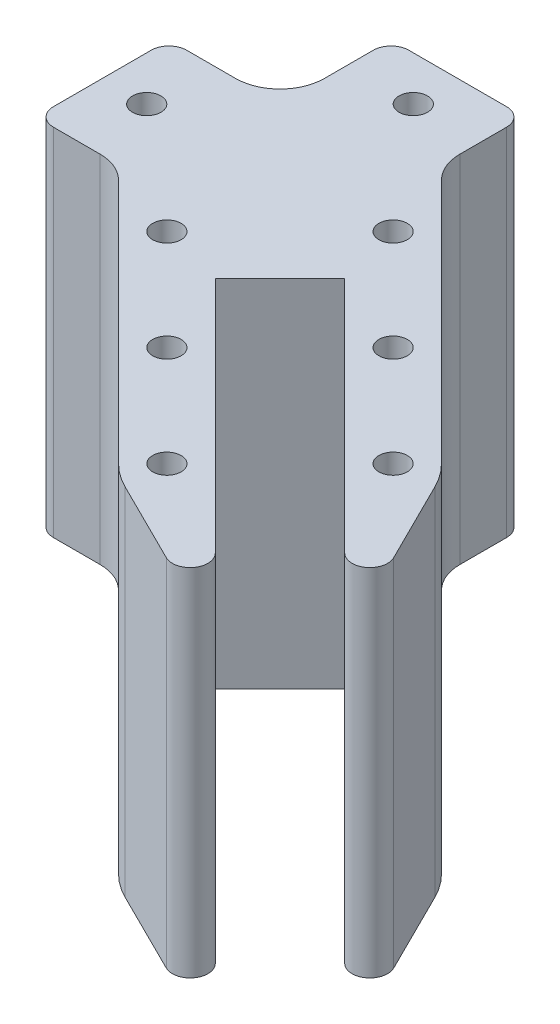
ISO-10303-21;
HEADER;
FILE_DESCRIPTION(('STEP AP214'),'2;1');
FILE_NAME('part.step','',(''),(''),'','','');
FILE_SCHEMA(('AUTOMOTIVE_DESIGN { 1 0 10303 214 1 1 1 1 }'));
ENDSEC;
DATA;
#1=APPLICATION_CONTEXT('core data for automotive mechanical design processes');
#2=APPLICATION_PROTOCOL_DEFINITION('international standard','automotive_design',2000,#1);
#3=PRODUCT_CONTEXT('',#1,'mechanical');
#4=PRODUCT('Part','Part','',(#3));
#5=PRODUCT_RELATED_PRODUCT_CATEGORY('part','',(#4));
#6=PRODUCT_DEFINITION_FORMATION('','',#4);
#7=PRODUCT_DEFINITION_CONTEXT('part definition',#1,'design');
#8=PRODUCT_DEFINITION('design','',#6,#7);
#9=PRODUCT_DEFINITION_SHAPE('','',#8);
#10=(LENGTH_UNIT() NAMED_UNIT(*) SI_UNIT(.MILLI.,.METRE.));
#11=(NAMED_UNIT(*) PLANE_ANGLE_UNIT() SI_UNIT($,.RADIAN.));
#12=(NAMED_UNIT(*) SI_UNIT($,.STERADIAN.) SOLID_ANGLE_UNIT());
#13=UNCERTAINTY_MEASURE_WITH_UNIT(LENGTH_MEASURE(1.E-05),#10,'distance_accuracy_value','');
#14=(GEOMETRIC_REPRESENTATION_CONTEXT(3) GLOBAL_UNCERTAINTY_ASSIGNED_CONTEXT((#13)) GLOBAL_UNIT_ASSIGNED_CONTEXT((#10,
#11,#12)) REPRESENTATION_CONTEXT('',''));
#15=CARTESIAN_POINT('',(0.,0.,0.));
#16=DIRECTION('',(0.,0.,1.));
#17=DIRECTION('',(1.,0.,0.));
#18=AXIS2_PLACEMENT_3D('',#15,#16,#17);
#19=CARTESIAN_POINT('',(69.3138164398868,40.,59.2021894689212));
#20=DIRECTION('',(0.,1.,0.));
#21=DIRECTION('',(0.,0.,1.));
#22=AXIS2_PLACEMENT_3D('',#19,#20,#21);
#23=PLANE('',#22);
#24=CARTESIAN_POINT('',(39.2821792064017,40.,26.5542571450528));
#25=DIRECTION('',(0.,1.,0.));
#26=DIRECTION('',(0.,0.,1.));
#27=AXIS2_PLACEMENT_3D('',#24,#25,#26);
#28=CIRCLE('',#27,1.60000000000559);
#29=CARTESIAN_POINT('',(39.2821792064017,40.,28.1542571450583));
#30=VERTEX_POINT('',#29);
#31=EDGE_CURVE('E770',#30,#30,#28,.T.);
#32=ORIENTED_EDGE('',*,*,#31,.F.);
#33=EDGE_LOOP('',(#32));
#34=FACE_BOUND('',#33,.T.);
#35=CARTESIAN_POINT('',(26.5542571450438,40.,39.2821792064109));
#36=DIRECTION('',(0.,1.,0.));
#37=DIRECTION('',(0.,0.,1.));
#38=AXIS2_PLACEMENT_3D('',#35,#36,#37);
#39=CIRCLE('',#38,1.6000000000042);
#40=CARTESIAN_POINT('',(26.5542571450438,40.,40.8821792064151));
#41=VERTEX_POINT('',#40);
#42=EDGE_CURVE('E790',#41,#41,#39,.T.);
#43=ORIENTED_EDGE('',*,*,#42,.F.);
#44=EDGE_LOOP('',(#43));
#45=FACE_BOUND('',#44,.T.);
#46=CARTESIAN_POINT('',(49.1816741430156,40.,61.9095962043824));
#47=DIRECTION('',(0.,1.,0.));
#48=DIRECTION('',(0.,0.,1.));
#49=AXIS2_PLACEMENT_3D('',#46,#47,#48);
#50=CIRCLE('',#49,1.60000000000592);
#51=CARTESIAN_POINT('',(49.1816741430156,40.,63.5095962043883));
#52=VERTEX_POINT('',#51);
#53=EDGE_CURVE('E802',#52,#52,#50,.T.);
#54=ORIENTED_EDGE('',*,*,#53,.F.);
#55=EDGE_LOOP('',(#54));
#56=FACE_BOUND('',#55,.T.);
#57=CARTESIAN_POINT('',(28.,40.,13.));
#58=DIRECTION('',(0.,1.,0.));
#59=DIRECTION('',(0.,0.,1.));
#60=AXIS2_PLACEMENT_3D('',#57,#58,#59);
#61=CIRCLE('',#60,1.6);
#62=CARTESIAN_POINT('',(28.,40.,14.6));
#63=VERTEX_POINT('',#62);
#64=EDGE_CURVE('E410',#63,#63,#61,.T.);
#65=ORIENTED_EDGE('',*,*,#64,.F.);
#66=EDGE_LOOP('',(#65));
#67=FACE_BOUND('',#66,.T.);
#68=DIRECTION('',(0.,0.,-1.));
#69=VECTOR('',#68,1.);
#70=CARTESIAN_POINT('',(35.5,40.,17.3273557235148));
#71=LINE('',#70,#69);
#72=CARTESIAN_POINT('',(35.5,40.,15.2562879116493));
#73=VERTEX_POINT('',#72);
#74=CARTESIAN_POINT('',(35.5,40.,10.));
#75=VERTEX_POINT('',#74);
#76=EDGE_CURVE('E413',#73,#75,#71,.T.);
#77=ORIENTED_EDGE('',*,*,#76,.T.);
#78=CARTESIAN_POINT('',(33.5,40.,10.));
#79=DIRECTION('',(0.,1.,0.));
#80=DIRECTION('',(0.,0.,1.));
#81=AXIS2_PLACEMENT_3D('',#78,#79,#80);
#82=CIRCLE('',#81,2.);
#83=CARTESIAN_POINT('',(33.5,40.,8.));
#84=VERTEX_POINT('',#83);
#85=EDGE_CURVE('E283',#75,#84,#82,.T.);
#86=ORIENTED_EDGE('',*,*,#85,.T.);
#87=DIRECTION('',(-1.,0.,0.));
#88=VECTOR('',#87,1.);
#89=CARTESIAN_POINT('',(35.5,40.,8.));
#90=LINE('',#89,#88);
#91=CARTESIAN_POINT('',(22.5,40.,8.));
#92=VERTEX_POINT('',#91);
#93=EDGE_CURVE('E392',#84,#92,#90,.T.);
#94=ORIENTED_EDGE('',*,*,#93,.T.);
#95=CARTESIAN_POINT('',(22.5,40.,10.));
#96=DIRECTION('',(0.,1.,0.));
#97=DIRECTION('',(0.,0.,1.));
#98=AXIS2_PLACEMENT_3D('',#95,#96,#97);
#99=CIRCLE('',#98,2.);
#100=CARTESIAN_POINT('',(20.5,40.,10.));
#101=VERTEX_POINT('',#100);
#102=EDGE_CURVE('E281',#92,#101,#99,.T.);
#103=ORIENTED_EDGE('',*,*,#102,.T.);
#104=DIRECTION('',(0.,0.,1.));
#105=VECTOR('',#104,1.);
#106=CARTESIAN_POINT('',(20.5,40.,8.));
#107=LINE('',#106,#105);
#108=CARTESIAN_POINT('',(20.5,40.,15.5));
#109=VERTEX_POINT('',#108);
#110=EDGE_CURVE('E385',#101,#109,#107,.T.);
#111=ORIENTED_EDGE('',*,*,#110,.T.);
#112=CARTESIAN_POINT('',(15.5,40.,15.5));
#113=DIRECTION('',(0.,1.,0.));
#114=DIRECTION('',(0.,0.,1.));
#115=AXIS2_PLACEMENT_3D('',#112,#113,#114);
#116=CIRCLE('',#115,5.);
#117=CARTESIAN_POINT('',(15.5,40.,20.5));
#118=VERTEX_POINT('',#117);
#119=EDGE_CURVE('E256',#109,#118,#116,.F.);
#120=ORIENTED_EDGE('',*,*,#119,.T.);
#121=DIRECTION('',(-1.,0.,0.));
#122=VECTOR('',#121,1.);
#123=CARTESIAN_POINT('',(20.5,40.,20.5));
#124=LINE('',#123,#122);
#125=CARTESIAN_POINT('',(10.,40.,20.5));
#126=VERTEX_POINT('',#125);
#127=EDGE_CURVE('E384',#118,#126,#124,.T.);
#128=ORIENTED_EDGE('',*,*,#127,.T.);
#129=CARTESIAN_POINT('',(10.,40.,22.5));
#130=DIRECTION('',(0.,1.,0.));
#131=DIRECTION('',(0.,0.,1.));
#132=AXIS2_PLACEMENT_3D('',#129,#130,#131);
#133=CIRCLE('',#132,2.);
#134=CARTESIAN_POINT('',(8.,40.,22.5));
#135=VERTEX_POINT('',#134);
#136=EDGE_CURVE('E278',#126,#135,#133,.T.);
#137=ORIENTED_EDGE('',*,*,#136,.T.);
#138=DIRECTION('',(0.,0.,1.));
#139=VECTOR('',#138,1.);
#140=CARTESIAN_POINT('',(8.,40.,20.5));
#141=LINE('',#140,#139);
#142=CARTESIAN_POINT('',(8.,40.,33.5));
#143=VERTEX_POINT('',#142);
#144=EDGE_CURVE('E297',#135,#143,#141,.T.);
#145=ORIENTED_EDGE('',*,*,#144,.T.);
#146=CARTESIAN_POINT('',(10.,40.,33.5));
#147=DIRECTION('',(0.,1.,0.));
#148=DIRECTION('',(0.,0.,1.));
#149=AXIS2_PLACEMENT_3D('',#146,#147,#148);
#150=CIRCLE('',#149,2.);
#151=CARTESIAN_POINT('',(10.,40.,35.5));
#152=VERTEX_POINT('',#151);
#153=EDGE_CURVE('E56',#143,#152,#150,.T.);
#154=ORIENTED_EDGE('',*,*,#153,.T.);
#155=DIRECTION('',(1.,0.,0.));
#156=VECTOR('',#155,1.);
#157=CARTESIAN_POINT('',(8.,40.,35.5));
#158=LINE('',#157,#156);
#159=CARTESIAN_POINT('',(15.256287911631,40.,35.5));
#160=VERTEX_POINT('',#159);
#161=EDGE_CURVE('E390',#152,#160,#158,.T.);
#162=ORIENTED_EDGE('',*,*,#161,.T.);
#163=CARTESIAN_POINT('',(15.256287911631,40.,40.5));
#164=DIRECTION('',(0.,1.,0.));
#165=DIRECTION('',(0.,0.,1.));
#166=AXIS2_PLACEMENT_3D('',#163,#164,#165);
#167=CIRCLE('',#166,5.);
#168=CARTESIAN_POINT('',(18.7918218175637,40.,36.9644660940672));
#169=VERTEX_POINT('',#168);
#170=EDGE_CURVE('E261',#160,#169,#167,.F.);
#171=ORIENTED_EDGE('',*,*,#170,.T.);
#172=DIRECTION('',(0.707106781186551,0.,0.707106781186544));
#173=VECTOR('',#172,1.);
#174=CARTESIAN_POINT('',(17.3273557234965,40.,35.5));
#175=LINE('',#174,#173);
#176=CARTESIAN_POINT('',(46.4593130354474,40.,64.6319573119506));
#177=VERTEX_POINT('',#176);
#178=EDGE_CURVE('E397',#169,#177,#175,.T.);
#179=ORIENTED_EDGE('',*,*,#178,.T.);
#180=CARTESIAN_POINT('',(53.5332062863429,40.,57.5580640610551));
#181=DIRECTION('',(0.,1.,0.));
#182=DIRECTION('',(0.,0.,1.));
#183=AXIS2_PLACEMENT_3D('',#180,#181,#182);
#184=CIRCLE('',#183,10.0039957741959);
#185=CARTESIAN_POINT('',(49.080609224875,40.,66.5165411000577));
#186=VERTEX_POINT('',#185);
#187=EDGE_CURVE('E399',#177,#186,#184,.T.);
#188=ORIENTED_EDGE('',*,*,#187,.T.);
#189=DIRECTION('',(0.895489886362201,0.,0.445081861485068));
#190=VECTOR('',#189,1.);
#191=CARTESIAN_POINT('',(49.080609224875,40.,66.5165411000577));
#192=LINE('',#191,#190);
#193=CARTESIAN_POINT('',(58.3120257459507,40.,71.1047962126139));
#194=VERTEX_POINT('',#193);
#195=EDGE_CURVE('E401',#186,#194,#192,.T.);
#196=ORIENTED_EDGE('',*,*,#195,.T.);
#197=CARTESIAN_POINT('',(59.2021894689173,40.,69.313816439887));
#198=DIRECTION('',(0.,1.,0.));
#199=DIRECTION('',(0.,0.,-1.));
#200=AXIS2_PLACEMENT_3D('',#197,#198,#199);
#201=CIRCLE('',#200,2.00000000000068);
#202=CARTESIAN_POINT('',(60.6164030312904,40.,67.8996028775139));
#203=VERTEX_POINT('',#202);
#204=EDGE_CURVE('E403',#194,#203,#201,.T.);
#205=ORIENTED_EDGE('',*,*,#204,.T.);
#206=DIRECTION('',(-0.70710678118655,0.,-0.707106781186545));
#207=VECTOR('',#206,1.);
#208=CARTESIAN_POINT('',(60.6164030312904,40.,67.8996028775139));
#209=LINE('',#208,#207);
#210=CARTESIAN_POINT('',(33.8728123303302,40.,41.1560121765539));
#211=VERTEX_POINT('',#210);
#212=EDGE_CURVE('E405',#203,#211,#209,.T.);
#213=ORIENTED_EDGE('',*,*,#212,.T.);
#214=DIRECTION('',(0.707106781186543,0.,-0.707106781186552));
#215=VECTOR('',#214,1.);
#216=CARTESIAN_POINT('',(33.8728123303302,40.,41.1560121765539));
#217=LINE('',#216,#215);
#218=CARTESIAN_POINT('',(41.1560121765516,40.,33.8728123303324));
#219=VERTEX_POINT('',#218);
#220=EDGE_CURVE('E407',#211,#219,#217,.T.);
#221=ORIENTED_EDGE('',*,*,#220,.T.);
#222=DIRECTION('',(0.707106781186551,0.,0.707106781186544));
#223=VECTOR('',#222,1.);
#224=CARTESIAN_POINT('',(41.1560121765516,40.,33.8728123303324));
#225=LINE('',#224,#223);
#226=CARTESIAN_POINT('',(67.8996028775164,40.,60.6164030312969));
#227=VERTEX_POINT('',#226);
#228=EDGE_CURVE('E218',#219,#227,#225,.T.);
#229=ORIENTED_EDGE('',*,*,#228,.T.);
#230=CARTESIAN_POINT('',(69.3138164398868,40.,59.2021894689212));
#231=DIRECTION('',(0.,1.,0.));
#232=DIRECTION('',(0.,0.,1.));
#233=AXIS2_PLACEMENT_3D('',#230,#231,#232);
#234=CIRCLE('',#233,2.00000000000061);
#235=CARTESIAN_POINT('',(71.1047962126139,40.,58.3120257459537));
#236=VERTEX_POINT('',#235);
#237=EDGE_CURVE('E212',#227,#236,#234,.T.);
#238=ORIENTED_EDGE('',*,*,#237,.T.);
#239=DIRECTION('',(-0.445081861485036,0.,-0.895489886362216));
#240=VECTOR('',#239,1.);
#241=CARTESIAN_POINT('',(71.1047962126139,40.,58.3120257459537));
#242=LINE('',#241,#240);
#243=CARTESIAN_POINT('',(66.516541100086,40.,49.0806092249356));
#244=VERTEX_POINT('',#243);
#245=EDGE_CURVE('E202',#236,#244,#242,.T.);
#246=ORIENTED_EDGE('',*,*,#245,.T.);
#247=CARTESIAN_POINT('',(57.558064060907,40.,53.5332062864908));
#248=DIRECTION('',(0.,1.,0.));
#249=DIRECTION('',(0.,0.,-1.));
#250=AXIS2_PLACEMENT_3D('',#247,#248,#249);
#251=CIRCLE('',#250,10.0039957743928);
#252=CARTESIAN_POINT('',(64.6319573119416,40.,46.459313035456));
#253=VERTEX_POINT('',#252);
#254=EDGE_CURVE('E211',#244,#253,#251,.T.);
#255=ORIENTED_EDGE('',*,*,#254,.T.);
#256=DIRECTION('',(-0.707106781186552,0.,-0.707106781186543));
#257=VECTOR('',#256,1.);
#258=CARTESIAN_POINT('',(64.6319573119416,40.,46.459313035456));
#259=LINE('',#258,#257);
#260=CARTESIAN_POINT('',(36.9644660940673,40.,18.791821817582));
#261=VERTEX_POINT('',#260);
#262=EDGE_CURVE('E357',#253,#261,#259,.T.);
#263=ORIENTED_EDGE('',*,*,#262,.T.);
#264=CARTESIAN_POINT('',(40.5,40.,15.2562879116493));
#265=DIRECTION('',(0.,1.,0.));
#266=DIRECTION('',(0.,0.,1.));
#267=AXIS2_PLACEMENT_3D('',#264,#265,#266);
#268=CIRCLE('',#267,5.);
#269=EDGE_CURVE('E251',#261,#73,#268,.F.);
#270=ORIENTED_EDGE('',*,*,#269,.T.);
#271=EDGE_LOOP('',(#77,#86,#94,#103,#111,#120,#128,#137,#145,#154,#162,#171,#179,#188,#196,#205,
#213,#221,#229,#238,#246,#255,#263,#270));
#272=FACE_BOUND('',#271,.T.);
#273=CARTESIAN_POINT('',(13.,40.,28.));
#274=DIRECTION('',(0.,1.,0.));
#275=DIRECTION('',(0.,0.,1.));
#276=AXIS2_PLACEMENT_3D('',#273,#274,#275);
#277=CIRCLE('',#276,1.6);
#278=CARTESIAN_POINT('',(13.,40.,29.6));
#279=VERTEX_POINT('',#278);
#280=EDGE_CURVE('E808',#279,#279,#277,.T.);
#281=ORIENTED_EDGE('',*,*,#280,.F.);
#282=EDGE_LOOP('',(#281));
#283=FACE_BOUND('',#282,.T.);
#284=CARTESIAN_POINT('',(37.8679656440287,40.,50.5958877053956));
#285=DIRECTION('',(0.,1.,0.));
#286=DIRECTION('',(0.,0.,1.));
#287=AXIS2_PLACEMENT_3D('',#284,#285,#286);
#288=CIRCLE('',#287,1.6000000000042);
#289=CARTESIAN_POINT('',(37.8679656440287,40.,52.1958877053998));
#290=VERTEX_POINT('',#289);
#291=EDGE_CURVE('E796',#290,#290,#288,.T.);
#292=ORIENTED_EDGE('',*,*,#291,.F.);
#293=EDGE_LOOP('',(#292));
#294=FACE_BOUND('',#293,.T.);
#295=CARTESIAN_POINT('',(50.5958877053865,40.,37.8679656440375));
#296=DIRECTION('',(0.,1.,0.));
#297=DIRECTION('',(0.,0.,1.));
#298=AXIS2_PLACEMENT_3D('',#295,#296,#297);
#299=CIRCLE('',#298,1.60000000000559);
#300=CARTESIAN_POINT('',(50.5958877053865,40.,39.4679656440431));
#301=VERTEX_POINT('',#300);
#302=EDGE_CURVE('E784',#301,#301,#299,.T.);
#303=ORIENTED_EDGE('',*,*,#302,.F.);
#304=EDGE_LOOP('',(#303));
#305=FACE_BOUND('',#304,.T.);
#306=CARTESIAN_POINT('',(61.9095962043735,40.,49.1816741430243));
#307=DIRECTION('',(0.,1.,0.));
#308=DIRECTION('',(0.,0.,1.));
#309=AXIS2_PLACEMENT_3D('',#306,#307,#308);
#310=CIRCLE('',#309,1.60000000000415);
#311=CARTESIAN_POINT('',(61.9095962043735,40.,50.7816741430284));
#312=VERTEX_POINT('',#311);
#313=EDGE_CURVE('E775',#312,#312,#310,.T.);
#314=ORIENTED_EDGE('',*,*,#313,.F.);
#315=EDGE_LOOP('',(#314));
#316=FACE_BOUND('',#315,.T.);
#317=ADVANCED_FACE('F41',(#34,#45,#56,#67,#272,#283,#294,#305,#316),#23,.T.);
#318=CARTESIAN_POINT('',(69.3138164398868,0.,59.2021894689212));
#319=DIRECTION('',(0.,1.,0.));
#320=DIRECTION('',(0.,0.,1.));
#321=AXIS2_PLACEMENT_3D('',#318,#319,#320);
#322=PLANE('',#321);
#323=DIRECTION('',(-1.,0.,0.));
#324=VECTOR('',#323,1.);
#325=CARTESIAN_POINT('',(35.5,0.,8.));
#326=LINE('',#325,#324);
#327=CARTESIAN_POINT('',(33.5,0.,8.));
#328=VERTEX_POINT('',#327);
#329=CARTESIAN_POINT('',(22.5,0.,8.));
#330=VERTEX_POINT('',#329);
#331=EDGE_CURVE('E365',#328,#330,#326,.T.);
#332=ORIENTED_EDGE('',*,*,#331,.F.);
#333=CARTESIAN_POINT('',(33.5,0.,10.));
#334=DIRECTION('',(0.,1.,0.));
#335=DIRECTION('',(0.,0.,1.));
#336=AXIS2_PLACEMENT_3D('',#333,#334,#335);
#337=CIRCLE('',#336,2.);
#338=CARTESIAN_POINT('',(35.5,0.,10.));
#339=VERTEX_POINT('',#338);
#340=EDGE_CURVE('E274',#328,#339,#337,.F.);
#341=ORIENTED_EDGE('',*,*,#340,.T.);
#342=DIRECTION('',(0.,0.,-1.));
#343=VECTOR('',#342,1.);
#344=CARTESIAN_POINT('',(35.5,0.,17.3273557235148));
#345=LINE('',#344,#343);
#346=CARTESIAN_POINT('',(35.5,0.,15.2562879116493));
#347=VERTEX_POINT('',#346);
#348=EDGE_CURVE('E362',#347,#339,#345,.T.);
#349=ORIENTED_EDGE('',*,*,#348,.F.);
#350=CARTESIAN_POINT('',(40.5,0.,15.2562879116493));
#351=DIRECTION('',(0.,1.,0.));
#352=DIRECTION('',(0.,0.,1.));
#353=AXIS2_PLACEMENT_3D('',#350,#351,#352);
#354=CIRCLE('',#353,5.);
#355=CARTESIAN_POINT('',(36.9644660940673,0.,18.791821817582));
#356=VERTEX_POINT('',#355);
#357=EDGE_CURVE('E249',#347,#356,#354,.T.);
#358=ORIENTED_EDGE('',*,*,#357,.T.);
#359=DIRECTION('',(-0.707106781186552,0.,-0.707106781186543));
#360=VECTOR('',#359,1.);
#361=CARTESIAN_POINT('',(64.6319573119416,0.,46.459313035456));
#362=LINE('',#361,#360);
#363=CARTESIAN_POINT('',(64.6319573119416,0.,46.459313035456));
#364=VERTEX_POINT('',#363);
#365=EDGE_CURVE('E354',#364,#356,#362,.T.);
#366=ORIENTED_EDGE('',*,*,#365,.F.);
#367=CARTESIAN_POINT('',(57.558064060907,0.,53.5332062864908));
#368=DIRECTION('',(0.,1.,0.));
#369=DIRECTION('',(0.,0.,-1.));
#370=AXIS2_PLACEMENT_3D('',#367,#368,#369);
#371=CIRCLE('',#370,10.0039957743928);
#372=CARTESIAN_POINT('',(66.516541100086,0.,49.0806092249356));
#373=VERTEX_POINT('',#372);
#374=EDGE_CURVE('E360',#373,#364,#371,.T.);
#375=ORIENTED_EDGE('',*,*,#374,.F.);
#376=DIRECTION('',(-0.445081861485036,0.,-0.895489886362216));
#377=VECTOR('',#376,1.);
#378=CARTESIAN_POINT('',(71.1047962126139,0.,58.3120257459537));
#379=LINE('',#378,#377);
#380=CARTESIAN_POINT('',(71.1047962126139,0.,58.3120257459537));
#381=VERTEX_POINT('',#380);
#382=EDGE_CURVE('E367',#381,#373,#379,.T.);
#383=ORIENTED_EDGE('',*,*,#382,.F.);
#384=CARTESIAN_POINT('',(69.3138164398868,0.,59.2021894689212));
#385=DIRECTION('',(0.,1.,0.));
#386=DIRECTION('',(0.,0.,1.));
#387=AXIS2_PLACEMENT_3D('',#384,#385,#386);
#388=CIRCLE('',#387,2.00000000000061);
#389=CARTESIAN_POINT('',(67.8996028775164,0.,60.6164030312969));
#390=VERTEX_POINT('',#389);
#391=EDGE_CURVE('E226',#390,#381,#388,.T.);
#392=ORIENTED_EDGE('',*,*,#391,.F.);
#393=DIRECTION('',(0.707106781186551,0.,0.707106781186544));
#394=VECTOR('',#393,1.);
#395=CARTESIAN_POINT('',(41.1560121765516,0.,33.8728123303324));
#396=LINE('',#395,#394);
#397=CARTESIAN_POINT('',(41.1560121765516,0.,33.8728123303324));
#398=VERTEX_POINT('',#397);
#399=EDGE_CURVE('E222',#398,#390,#396,.T.);
#400=ORIENTED_EDGE('',*,*,#399,.F.);
#401=DIRECTION('',(0.707106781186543,0.,-0.707106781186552));
#402=VECTOR('',#401,1.);
#403=CARTESIAN_POINT('',(33.8728123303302,0.,41.1560121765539));
#404=LINE('',#403,#402);
#405=CARTESIAN_POINT('',(33.8728123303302,0.,41.1560121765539));
#406=VERTEX_POINT('',#405);
#407=EDGE_CURVE('E325',#406,#398,#404,.T.);
#408=ORIENTED_EDGE('',*,*,#407,.F.);
#409=DIRECTION('',(-0.70710678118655,0.,-0.707106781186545));
#410=VECTOR('',#409,1.);
#411=CARTESIAN_POINT('',(60.6164030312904,0.,67.8996028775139));
#412=LINE('',#411,#410);
#413=CARTESIAN_POINT('',(60.6164030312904,0.,67.8996028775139));
#414=VERTEX_POINT('',#413);
#415=EDGE_CURVE('E323',#414,#406,#412,.T.);
#416=ORIENTED_EDGE('',*,*,#415,.F.);
#417=CARTESIAN_POINT('',(59.2021894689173,0.,69.313816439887));
#418=DIRECTION('',(0.,1.,0.));
#419=DIRECTION('',(0.,0.,-1.));
#420=AXIS2_PLACEMENT_3D('',#417,#418,#419);
#421=CIRCLE('',#420,2.00000000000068);
#422=CARTESIAN_POINT('',(58.3120257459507,0.,71.1047962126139));
#423=VERTEX_POINT('',#422);
#424=EDGE_CURVE('E321',#423,#414,#421,.T.);
#425=ORIENTED_EDGE('',*,*,#424,.F.);
#426=DIRECTION('',(0.895489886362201,0.,0.445081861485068));
#427=VECTOR('',#426,1.);
#428=CARTESIAN_POINT('',(49.080609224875,0.,66.5165411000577));
#429=LINE('',#428,#427);
#430=CARTESIAN_POINT('',(49.080609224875,0.,66.5165411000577));
#431=VERTEX_POINT('',#430);
#432=EDGE_CURVE('E319',#431,#423,#429,.T.);
#433=ORIENTED_EDGE('',*,*,#432,.F.);
#434=CARTESIAN_POINT('',(53.5332062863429,0.,57.5580640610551));
#435=DIRECTION('',(0.,1.,0.));
#436=DIRECTION('',(0.,0.,1.));
#437=AXIS2_PLACEMENT_3D('',#434,#435,#436);
#438=CIRCLE('',#437,10.0039957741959);
#439=CARTESIAN_POINT('',(46.4593130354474,0.,64.6319573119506));
#440=VERTEX_POINT('',#439);
#441=EDGE_CURVE('E317',#440,#431,#438,.T.);
#442=ORIENTED_EDGE('',*,*,#441,.F.);
#443=DIRECTION('',(0.707106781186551,0.,0.707106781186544));
#444=VECTOR('',#443,1.);
#445=CARTESIAN_POINT('',(17.3273557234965,0.,35.5));
#446=LINE('',#445,#444);
#447=CARTESIAN_POINT('',(18.7918218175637,0.,36.9644660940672));
#448=VERTEX_POINT('',#447);
#449=EDGE_CURVE('E310',#448,#440,#446,.T.);
#450=ORIENTED_EDGE('',*,*,#449,.F.);
#451=CARTESIAN_POINT('',(15.256287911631,0.,40.5));
#452=DIRECTION('',(0.,1.,0.));
#453=DIRECTION('',(0.,0.,1.));
#454=AXIS2_PLACEMENT_3D('',#451,#452,#453);
#455=CIRCLE('',#454,5.);
#456=CARTESIAN_POINT('',(15.256287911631,0.,35.5));
#457=VERTEX_POINT('',#456);
#458=EDGE_CURVE('E258',#448,#457,#455,.T.);
#459=ORIENTED_EDGE('',*,*,#458,.T.);
#460=DIRECTION('',(1.,0.,0.));
#461=VECTOR('',#460,1.);
#462=CARTESIAN_POINT('',(8.,0.,35.5));
#463=LINE('',#462,#461);
#464=CARTESIAN_POINT('',(10.,0.,35.5));
#465=VERTEX_POINT('',#464);
#466=EDGE_CURVE('E307',#465,#457,#463,.T.);
#467=ORIENTED_EDGE('',*,*,#466,.F.);
#468=CARTESIAN_POINT('',(10.,0.,33.5));
#469=DIRECTION('',(0.,1.,0.));
#470=DIRECTION('',(0.,0.,1.));
#471=AXIS2_PLACEMENT_3D('',#468,#469,#470);
#472=CIRCLE('',#471,2.);
#473=CARTESIAN_POINT('',(8.,0.,33.5));
#474=VERTEX_POINT('',#473);
#475=EDGE_CURVE('E270',#465,#474,#472,.F.);
#476=ORIENTED_EDGE('',*,*,#475,.T.);
#477=DIRECTION('',(0.,0.,1.));
#478=VECTOR('',#477,1.);
#479=CARTESIAN_POINT('',(8.,0.,20.5));
#480=LINE('',#479,#478);
#481=CARTESIAN_POINT('',(8.,0.,22.5));
#482=VERTEX_POINT('',#481);
#483=EDGE_CURVE('E296',#482,#474,#480,.T.);
#484=ORIENTED_EDGE('',*,*,#483,.F.);
#485=CARTESIAN_POINT('',(10.,0.,22.5));
#486=DIRECTION('',(0.,1.,0.));
#487=DIRECTION('',(0.,0.,1.));
#488=AXIS2_PLACEMENT_3D('',#485,#486,#487);
#489=CIRCLE('',#488,2.);
#490=CARTESIAN_POINT('',(10.,0.,20.5));
#491=VERTEX_POINT('',#490);
#492=EDGE_CURVE('E268',#482,#491,#489,.F.);
#493=ORIENTED_EDGE('',*,*,#492,.T.);
#494=DIRECTION('',(-1.,0.,0.));
#495=VECTOR('',#494,1.);
#496=CARTESIAN_POINT('',(20.5,0.,20.5));
#497=LINE('',#496,#495);
#498=CARTESIAN_POINT('',(15.5,0.,20.5));
#499=VERTEX_POINT('',#498);
#500=EDGE_CURVE('E308',#499,#491,#497,.T.);
#501=ORIENTED_EDGE('',*,*,#500,.F.);
#502=CARTESIAN_POINT('',(15.5,0.,15.5));
#503=DIRECTION('',(0.,1.,0.));
#504=DIRECTION('',(0.,0.,1.));
#505=AXIS2_PLACEMENT_3D('',#502,#503,#504);
#506=CIRCLE('',#505,5.);
#507=CARTESIAN_POINT('',(20.5,0.,15.5));
#508=VERTEX_POINT('',#507);
#509=EDGE_CURVE('E253',#499,#508,#506,.T.);
#510=ORIENTED_EDGE('',*,*,#509,.T.);
#511=DIRECTION('',(0.,0.,1.));
#512=VECTOR('',#511,1.);
#513=CARTESIAN_POINT('',(20.5,0.,8.));
#514=LINE('',#513,#512);
#515=CARTESIAN_POINT('',(20.5,0.,10.));
#516=VERTEX_POINT('',#515);
#517=EDGE_CURVE('E312',#516,#508,#514,.T.);
#518=ORIENTED_EDGE('',*,*,#517,.F.);
#519=CARTESIAN_POINT('',(22.5,0.,10.));
#520=DIRECTION('',(0.,1.,0.));
#521=DIRECTION('',(0.,0.,1.));
#522=AXIS2_PLACEMENT_3D('',#519,#520,#521);
#523=CIRCLE('',#522,2.);
#524=EDGE_CURVE('E272',#516,#330,#523,.F.);
#525=ORIENTED_EDGE('',*,*,#524,.T.);
#526=EDGE_LOOP('',(#332,#341,#349,#358,#366,#375,#383,#392,#400,#408,#416,#425,#433,#442,#450,
#459,#467,#476,#484,#493,#501,#510,#518,#525));
#527=FACE_BOUND('',#526,.T.);
#528=CARTESIAN_POINT('',(28.,0.,13.));
#529=DIRECTION('',(0.,1.,0.));
#530=DIRECTION('',(0.,0.,1.));
#531=AXIS2_PLACEMENT_3D('',#528,#529,#530);
#532=CIRCLE('',#531,1.6);
#533=CARTESIAN_POINT('',(28.,0.,14.6));
#534=VERTEX_POINT('',#533);
#535=EDGE_CURVE('E811',#534,#534,#532,.T.);
#536=ORIENTED_EDGE('',*,*,#535,.T.);
#537=EDGE_LOOP('',(#536));
#538=FACE_BOUND('',#537,.T.);
#539=CARTESIAN_POINT('',(13.,0.,28.));
#540=DIRECTION('',(0.,1.,0.));
#541=DIRECTION('',(0.,0.,1.));
#542=AXIS2_PLACEMENT_3D('',#539,#540,#541);
#543=CIRCLE('',#542,1.6);
#544=CARTESIAN_POINT('',(13.,0.,29.6));
#545=VERTEX_POINT('',#544);
#546=EDGE_CURVE('E805',#545,#545,#543,.T.);
#547=ORIENTED_EDGE('',*,*,#546,.T.);
#548=EDGE_LOOP('',(#547));
#549=FACE_BOUND('',#548,.T.);
#550=CARTESIAN_POINT('',(49.1816741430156,0.,61.9095962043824));
#551=DIRECTION('',(0.,1.,0.));
#552=DIRECTION('',(0.,0.,1.));
#553=AXIS2_PLACEMENT_3D('',#550,#551,#552);
#554=CIRCLE('',#553,1.60000000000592);
#555=CARTESIAN_POINT('',(49.1816741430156,0.,63.5095962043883));
#556=VERTEX_POINT('',#555);
#557=EDGE_CURVE('E799',#556,#556,#554,.T.);
#558=ORIENTED_EDGE('',*,*,#557,.T.);
#559=EDGE_LOOP('',(#558));
#560=FACE_BOUND('',#559,.T.);
#561=CARTESIAN_POINT('',(37.8679656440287,0.,50.5958877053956));
#562=DIRECTION('',(0.,1.,0.));
#563=DIRECTION('',(0.,0.,1.));
#564=AXIS2_PLACEMENT_3D('',#561,#562,#563);
#565=CIRCLE('',#564,1.6000000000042);
#566=CARTESIAN_POINT('',(37.8679656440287,0.,52.1958877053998));
#567=VERTEX_POINT('',#566);
#568=EDGE_CURVE('E793',#567,#567,#565,.T.);
#569=ORIENTED_EDGE('',*,*,#568,.T.);
#570=EDGE_LOOP('',(#569));
#571=FACE_BOUND('',#570,.T.);
#572=CARTESIAN_POINT('',(26.5542571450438,0.,39.2821792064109));
#573=DIRECTION('',(0.,1.,0.));
#574=DIRECTION('',(0.,0.,1.));
#575=AXIS2_PLACEMENT_3D('',#572,#573,#574);
#576=CIRCLE('',#575,1.6000000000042);
#577=CARTESIAN_POINT('',(26.5542571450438,0.,40.8821792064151));
#578=VERTEX_POINT('',#577);
#579=EDGE_CURVE('E787',#578,#578,#576,.T.);
#580=ORIENTED_EDGE('',*,*,#579,.T.);
#581=EDGE_LOOP('',(#580));
#582=FACE_BOUND('',#581,.T.);
#583=CARTESIAN_POINT('',(50.5958877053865,0.,37.8679656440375));
#584=DIRECTION('',(0.,1.,0.));
#585=DIRECTION('',(0.,0.,1.));
#586=AXIS2_PLACEMENT_3D('',#583,#584,#585);
#587=CIRCLE('',#586,1.60000000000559);
#588=CARTESIAN_POINT('',(50.5958877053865,0.,39.4679656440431));
#589=VERTEX_POINT('',#588);
#590=EDGE_CURVE('E777',#589,#589,#587,.T.);
#591=ORIENTED_EDGE('',*,*,#590,.T.);
#592=EDGE_LOOP('',(#591));
#593=FACE_BOUND('',#592,.T.);
#594=CARTESIAN_POINT('',(39.2821792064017,0.,26.5542571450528));
#595=DIRECTION('',(0.,1.,0.));
#596=DIRECTION('',(0.,0.,1.));
#597=AXIS2_PLACEMENT_3D('',#594,#595,#596);
#598=CIRCLE('',#597,1.60000000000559);
#599=CARTESIAN_POINT('',(39.2821792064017,0.,28.1542571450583));
#600=VERTEX_POINT('',#599);
#601=EDGE_CURVE('E773',#600,#600,#598,.T.);
#602=ORIENTED_EDGE('',*,*,#601,.T.);
#603=EDGE_LOOP('',(#602));
#604=FACE_BOUND('',#603,.T.);
#605=CARTESIAN_POINT('',(61.9095962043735,0.,49.1816741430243));
#606=DIRECTION('',(0.,1.,0.));
#607=DIRECTION('',(0.,0.,1.));
#608=AXIS2_PLACEMENT_3D('',#605,#606,#607);
#609=CIRCLE('',#608,1.60000000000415);
#610=CARTESIAN_POINT('',(61.9095962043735,0.,50.7816741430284));
#611=VERTEX_POINT('',#610);
#612=EDGE_CURVE('E780',#611,#611,#609,.T.);
#613=ORIENTED_EDGE('',*,*,#612,.T.);
#614=EDGE_LOOP('',(#613));
#615=FACE_BOUND('',#614,.T.);
#616=ADVANCED_FACE('F302',(#527,#538,#549,#560,#571,#582,#593,#604,#615),#322,.F.);
#617=CARTESIAN_POINT('',(69.3138164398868,40.,59.2021894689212));
#618=DIRECTION('',(0.,-1.,0.));
#619=DIRECTION('',(0.,0.,-1.));
#620=AXIS2_PLACEMENT_3D('',#617,#618,#619);
#621=CYLINDRICAL_SURFACE('',#620,2.00000000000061);
#622=ORIENTED_EDGE('',*,*,#391,.T.);
#623=DIRECTION('',(0.,-1.,0.));
#624=VECTOR('',#623,1.);
#625=CARTESIAN_POINT('',(71.1047962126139,40.,58.3120257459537));
#626=LINE('',#625,#624);
#627=EDGE_CURVE('E206',#236,#381,#626,.T.);
#628=ORIENTED_EDGE('',*,*,#627,.F.);
#629=ORIENTED_EDGE('',*,*,#237,.F.);
#630=DIRECTION('',(0.,-1.,0.));
#631=VECTOR('',#630,1.);
#632=CARTESIAN_POINT('',(67.8996028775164,40.,60.6164030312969));
#633=LINE('',#632,#631);
#634=EDGE_CURVE('E328',#227,#390,#633,.T.);
#635=ORIENTED_EDGE('',*,*,#634,.T.);
#636=EDGE_LOOP('',(#622,#628,#629,#635));
#637=FACE_BOUND('',#636,.T.);
#638=ADVANCED_FACE('F224',(#637),#621,.T.);
#639=CARTESIAN_POINT('',(71.1047962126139,40.,58.3120257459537));
#640=DIRECTION('',(-0.895489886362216,0.,0.445081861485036));
#641=DIRECTION('',(0.445081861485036,0.,0.895489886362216));
#642=AXIS2_PLACEMENT_3D('',#639,#640,#641);
#643=PLANE('',#642);
#644=ORIENTED_EDGE('',*,*,#382,.T.);
#645=DIRECTION('',(0.,-1.,0.));
#646=VECTOR('',#645,1.);
#647=CARTESIAN_POINT('',(66.516541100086,40.,49.0806092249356));
#648=LINE('',#647,#646);
#649=EDGE_CURVE('E209',#244,#373,#648,.T.);
#650=ORIENTED_EDGE('',*,*,#649,.F.);
#651=ORIENTED_EDGE('',*,*,#245,.F.);
#652=ORIENTED_EDGE('',*,*,#627,.T.);
#653=EDGE_LOOP('',(#644,#650,#651,#652));
#654=FACE_BOUND('',#653,.T.);
#655=ADVANCED_FACE('F204',(#654),#643,.F.);
#656=CARTESIAN_POINT('',(57.558064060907,40.,53.5332062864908));
#657=DIRECTION('',(0.,-1.,0.));
#658=DIRECTION('',(0.,0.,-1.));
#659=AXIS2_PLACEMENT_3D('',#656,#657,#658);
#660=CYLINDRICAL_SURFACE('',#659,10.0039957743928);
#661=ORIENTED_EDGE('',*,*,#374,.T.);
#662=DIRECTION('',(0.,-1.,0.));
#663=VECTOR('',#662,1.);
#664=CARTESIAN_POINT('',(64.6319573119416,40.,46.459313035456));
#665=LINE('',#664,#663);
#666=EDGE_CURVE('E232',#253,#364,#665,.T.);
#667=ORIENTED_EDGE('',*,*,#666,.F.);
#668=ORIENTED_EDGE('',*,*,#254,.F.);
#669=ORIENTED_EDGE('',*,*,#649,.T.);
#670=EDGE_LOOP('',(#661,#667,#668,#669));
#671=FACE_BOUND('',#670,.T.);
#672=ADVANCED_FACE('F411',(#671),#660,.T.);
#673=CARTESIAN_POINT('',(64.6319573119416,40.,46.459313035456));
#674=DIRECTION('',(-0.707106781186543,0.,0.707106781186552));
#675=DIRECTION('',(0.707106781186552,0.,0.707106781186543));
#676=AXIS2_PLACEMENT_3D('',#673,#674,#675);
#677=PLANE('',#676);
#678=ORIENTED_EDGE('',*,*,#365,.T.);
#679=DIRECTION('',(0.,-1.,0.));
#680=VECTOR('',#679,1.);
#681=CARTESIAN_POINT('',(36.9644660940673,40.,18.791821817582));
#682=LINE('',#681,#680);
#683=EDGE_CURVE('E230',#356,#261,#682,.F.);
#684=ORIENTED_EDGE('',*,*,#683,.T.);
#685=ORIENTED_EDGE('',*,*,#262,.F.);
#686=ORIENTED_EDGE('',*,*,#666,.T.);
#687=EDGE_LOOP('',(#678,#684,#685,#686));
#688=FACE_BOUND('',#687,.T.);
#689=ADVANCED_FACE('F353',(#688),#677,.F.);
#690=CARTESIAN_POINT('',(35.5,40.,17.3273557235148));
#691=DIRECTION('',(-1.,0.,0.));
#692=DIRECTION('',(0.,0.,1.));
#693=AXIS2_PLACEMENT_3D('',#690,#691,#692);
#694=PLANE('',#693);
#695=ORIENTED_EDGE('',*,*,#348,.T.);
#696=DIRECTION('',(0.,-1.,0.));
#697=VECTOR('',#696,1.);
#698=CARTESIAN_POINT('',(35.5,40.,10.));
#699=LINE('',#698,#697);
#700=EDGE_CURVE('E276',#339,#75,#699,.F.);
#701=ORIENTED_EDGE('',*,*,#700,.T.);
#702=ORIENTED_EDGE('',*,*,#76,.F.);
#703=DIRECTION('',(0.,-1.,0.));
#704=VECTOR('',#703,1.);
#705=CARTESIAN_POINT('',(35.5,0.,15.2562879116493));
#706=LINE('',#705,#704);
#707=EDGE_CURVE('E227',#73,#347,#706,.T.);
#708=ORIENTED_EDGE('',*,*,#707,.T.);
#709=EDGE_LOOP('',(#695,#701,#702,#708));
#710=FACE_BOUND('',#709,.T.);
#711=ADVANCED_FACE('F430',(#710),#694,.F.);
#712=CARTESIAN_POINT('',(35.5,40.,8.));
#713=DIRECTION('',(0.,0.,1.));
#714=DIRECTION('',(1.,0.,0.));
#715=AXIS2_PLACEMENT_3D('',#712,#713,#714);
#716=PLANE('',#715);
#717=ORIENTED_EDGE('',*,*,#93,.F.);
#718=DIRECTION('',(0.,-1.,0.));
#719=VECTOR('',#718,1.);
#720=CARTESIAN_POINT('',(33.5,40.,8.));
#721=LINE('',#720,#719);
#722=EDGE_CURVE('E265',#84,#328,#721,.T.);
#723=ORIENTED_EDGE('',*,*,#722,.T.);
#724=ORIENTED_EDGE('',*,*,#331,.T.);
#725=DIRECTION('',(0.,-1.,0.));
#726=VECTOR('',#725,1.);
#727=CARTESIAN_POINT('',(22.5,40.,8.));
#728=LINE('',#727,#726);
#729=EDGE_CURVE('E263',#330,#92,#728,.F.);
#730=ORIENTED_EDGE('',*,*,#729,.T.);
#731=EDGE_LOOP('',(#717,#723,#724,#730));
#732=FACE_BOUND('',#731,.T.);
#733=ADVANCED_FACE('F425',(#732),#716,.F.);
#734=CARTESIAN_POINT('',(20.5,40.,8.));
#735=DIRECTION('',(1.,0.,0.));
#736=DIRECTION('',(0.,0.,-1.));
#737=AXIS2_PLACEMENT_3D('',#734,#735,#736);
#738=PLANE('',#737);
#739=ORIENTED_EDGE('',*,*,#110,.F.);
#740=DIRECTION('',(0.,-1.,0.));
#741=VECTOR('',#740,1.);
#742=CARTESIAN_POINT('',(20.5,40.,10.));
#743=LINE('',#742,#741);
#744=EDGE_CURVE('E285',#101,#516,#743,.T.);
#745=ORIENTED_EDGE('',*,*,#744,.T.);
#746=ORIENTED_EDGE('',*,*,#517,.T.);
#747=DIRECTION('',(0.,-1.,0.));
#748=VECTOR('',#747,1.);
#749=CARTESIAN_POINT('',(20.5,40.,15.5));
#750=LINE('',#749,#748);
#751=EDGE_CURVE('E240',#508,#109,#750,.F.);
#752=ORIENTED_EDGE('',*,*,#751,.T.);
#753=EDGE_LOOP('',(#739,#745,#746,#752));
#754=FACE_BOUND('',#753,.T.);
#755=ADVANCED_FACE('F375',(#754),#738,.F.);
#756=CARTESIAN_POINT('',(20.5,40.,20.5));
#757=DIRECTION('',(0.,0.,1.));
#758=DIRECTION('',(1.,0.,0.));
#759=AXIS2_PLACEMENT_3D('',#756,#757,#758);
#760=PLANE('',#759);
#761=ORIENTED_EDGE('',*,*,#500,.T.);
#762=DIRECTION('',(0.,-1.,0.));
#763=VECTOR('',#762,1.);
#764=CARTESIAN_POINT('',(10.,40.,20.5));
#765=LINE('',#764,#763);
#766=EDGE_CURVE('E11',#491,#126,#765,.F.);
#767=ORIENTED_EDGE('',*,*,#766,.T.);
#768=ORIENTED_EDGE('',*,*,#127,.F.);
#769=DIRECTION('',(0.,-1.,0.));
#770=VECTOR('',#769,1.);
#771=CARTESIAN_POINT('',(15.5,0.,20.5));
#772=LINE('',#771,#770);
#773=EDGE_CURVE('E237',#118,#499,#772,.T.);
#774=ORIENTED_EDGE('',*,*,#773,.T.);
#775=EDGE_LOOP('',(#761,#767,#768,#774));
#776=FACE_BOUND('',#775,.T.);
#777=ADVANCED_FACE('F387',(#776),#760,.F.);
#778=CARTESIAN_POINT('',(8.,40.,20.5));
#779=DIRECTION('',(1.,0.,0.));
#780=DIRECTION('',(0.,0.,-1.));
#781=AXIS2_PLACEMENT_3D('',#778,#779,#780);
#782=PLANE('',#781);
#783=ORIENTED_EDGE('',*,*,#483,.T.);
#784=DIRECTION('',(0.,-1.,0.));
#785=VECTOR('',#784,1.);
#786=CARTESIAN_POINT('',(8.,40.,33.5));
#787=LINE('',#786,#785);
#788=EDGE_CURVE('E49',#474,#143,#787,.F.);
#789=ORIENTED_EDGE('',*,*,#788,.T.);
#790=ORIENTED_EDGE('',*,*,#144,.F.);
#791=DIRECTION('',(0.,-1.,0.));
#792=VECTOR('',#791,1.);
#793=CARTESIAN_POINT('',(8.,40.,22.5));
#794=LINE('',#793,#792);
#795=EDGE_CURVE('E291',#135,#482,#794,.T.);
#796=ORIENTED_EDGE('',*,*,#795,.T.);
#797=EDGE_LOOP('',(#783,#789,#790,#796));
#798=FACE_BOUND('',#797,.T.);
#799=ADVANCED_FACE('F295',(#798),#782,.F.);
#800=CARTESIAN_POINT('',(8.,40.,35.5));
#801=DIRECTION('',(0.,0.,-1.));
#802=DIRECTION('',(-1.,0.,0.));
#803=AXIS2_PLACEMENT_3D('',#800,#801,#802);
#804=PLANE('',#803);
#805=ORIENTED_EDGE('',*,*,#161,.F.);
#806=DIRECTION('',(0.,-1.,0.));
#807=VECTOR('',#806,1.);
#808=CARTESIAN_POINT('',(10.,40.,35.5));
#809=LINE('',#808,#807);
#810=EDGE_CURVE('E288',#152,#465,#809,.T.);
#811=ORIENTED_EDGE('',*,*,#810,.T.);
#812=ORIENTED_EDGE('',*,*,#466,.T.);
#813=DIRECTION('',(0.,-1.,0.));
#814=VECTOR('',#813,1.);
#815=CARTESIAN_POINT('',(15.256287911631,40.,35.5));
#816=LINE('',#815,#814);
#817=EDGE_CURVE('E246',#457,#160,#816,.F.);
#818=ORIENTED_EDGE('',*,*,#817,.T.);
#819=EDGE_LOOP('',(#805,#811,#812,#818));
#820=FACE_BOUND('',#819,.T.);
#821=ADVANCED_FACE('F490',(#820),#804,.F.);
#822=CARTESIAN_POINT('',(17.3273557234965,40.,35.5));
#823=DIRECTION('',(0.707106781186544,0.,-0.707106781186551));
#824=DIRECTION('',(-0.707106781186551,0.,-0.707106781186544));
#825=AXIS2_PLACEMENT_3D('',#822,#823,#824);
#826=PLANE('',#825);
#827=ORIENTED_EDGE('',*,*,#178,.F.);
#828=DIRECTION('',(0.,-1.,0.));
#829=VECTOR('',#828,1.);
#830=CARTESIAN_POINT('',(18.7918218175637,0.,36.9644660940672));
#831=LINE('',#830,#829);
#832=EDGE_CURVE('E243',#169,#448,#831,.T.);
#833=ORIENTED_EDGE('',*,*,#832,.T.);
#834=ORIENTED_EDGE('',*,*,#449,.T.);
#835=DIRECTION('',(0.,-1.,0.));
#836=VECTOR('',#835,1.);
#837=CARTESIAN_POINT('',(46.4593130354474,40.,64.6319573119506));
#838=LINE('',#837,#836);
#839=EDGE_CURVE('E345',#177,#440,#838,.T.);
#840=ORIENTED_EDGE('',*,*,#839,.F.);
#841=EDGE_LOOP('',(#827,#833,#834,#840));
#842=FACE_BOUND('',#841,.T.);
#843=ADVANCED_FACE('F487',(#842),#826,.F.);
#844=CARTESIAN_POINT('',(53.5332062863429,40.,57.5580640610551));
#845=DIRECTION('',(0.,-1.,0.));
#846=DIRECTION('',(0.,0.,-1.));
#847=AXIS2_PLACEMENT_3D('',#844,#845,#846);
#848=CYLINDRICAL_SURFACE('',#847,10.0039957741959);
#849=ORIENTED_EDGE('',*,*,#441,.T.);
#850=DIRECTION('',(0.,-1.,0.));
#851=VECTOR('',#850,1.);
#852=CARTESIAN_POINT('',(49.080609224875,40.,66.5165411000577));
#853=LINE('',#852,#851);
#854=EDGE_CURVE('E342',#186,#431,#853,.T.);
#855=ORIENTED_EDGE('',*,*,#854,.F.);
#856=ORIENTED_EDGE('',*,*,#187,.F.);
#857=ORIENTED_EDGE('',*,*,#839,.T.);
#858=EDGE_LOOP('',(#849,#855,#856,#857));
#859=FACE_BOUND('',#858,.T.);
#860=ADVANCED_FACE('F483',(#859),#848,.T.);
#861=CARTESIAN_POINT('',(49.080609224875,40.,66.5165411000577));
#862=DIRECTION('',(0.445081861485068,0.,-0.895489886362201));
#863=DIRECTION('',(-0.895489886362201,0.,-0.445081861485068));
#864=AXIS2_PLACEMENT_3D('',#861,#862,#863);
#865=PLANE('',#864);
#866=ORIENTED_EDGE('',*,*,#432,.T.);
#867=DIRECTION('',(0.,-1.,0.));
#868=VECTOR('',#867,1.);
#869=CARTESIAN_POINT('',(58.3120257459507,40.,71.1047962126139));
#870=LINE('',#869,#868);
#871=EDGE_CURVE('E339',#194,#423,#870,.T.);
#872=ORIENTED_EDGE('',*,*,#871,.F.);
#873=ORIENTED_EDGE('',*,*,#195,.F.);
#874=ORIENTED_EDGE('',*,*,#854,.T.);
#875=EDGE_LOOP('',(#866,#872,#873,#874));
#876=FACE_BOUND('',#875,.T.);
#877=ADVANCED_FACE('F479',(#876),#865,.F.);
#878=CARTESIAN_POINT('',(59.2021894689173,40.,69.313816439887));
#879=DIRECTION('',(0.,-1.,0.));
#880=DIRECTION('',(0.,0.,-1.));
#881=AXIS2_PLACEMENT_3D('',#878,#879,#880);
#882=CYLINDRICAL_SURFACE('',#881,2.00000000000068);
#883=ORIENTED_EDGE('',*,*,#424,.T.);
#884=DIRECTION('',(0.,-1.,0.));
#885=VECTOR('',#884,1.);
#886=CARTESIAN_POINT('',(60.6164030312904,40.,67.8996028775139));
#887=LINE('',#886,#885);
#888=EDGE_CURVE('E336',#203,#414,#887,.T.);
#889=ORIENTED_EDGE('',*,*,#888,.F.);
#890=ORIENTED_EDGE('',*,*,#204,.F.);
#891=ORIENTED_EDGE('',*,*,#871,.T.);
#892=EDGE_LOOP('',(#883,#889,#890,#891));
#893=FACE_BOUND('',#892,.T.);
#894=ADVANCED_FACE('F475',(#893),#882,.T.);
#895=CARTESIAN_POINT('',(60.6164030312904,40.,67.8996028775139));
#896=DIRECTION('',(-0.707106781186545,0.,0.70710678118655));
#897=DIRECTION('',(0.70710678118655,0.,0.707106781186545));
#898=AXIS2_PLACEMENT_3D('',#895,#896,#897);
#899=PLANE('',#898);
#900=ORIENTED_EDGE('',*,*,#415,.T.);
#901=DIRECTION('',(0.,-1.,0.));
#902=VECTOR('',#901,1.);
#903=CARTESIAN_POINT('',(33.8728123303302,40.,41.1560121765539));
#904=LINE('',#903,#902);
#905=EDGE_CURVE('E333',#211,#406,#904,.T.);
#906=ORIENTED_EDGE('',*,*,#905,.F.);
#907=ORIENTED_EDGE('',*,*,#212,.F.);
#908=ORIENTED_EDGE('',*,*,#888,.T.);
#909=EDGE_LOOP('',(#900,#906,#907,#908));
#910=FACE_BOUND('',#909,.T.);
#911=ADVANCED_FACE('F471',(#910),#899,.F.);
#912=CARTESIAN_POINT('',(33.8728123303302,40.,41.1560121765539));
#913=DIRECTION('',(-0.707106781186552,0.,-0.707106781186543));
#914=DIRECTION('',(-0.707106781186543,0.,0.707106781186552));
#915=AXIS2_PLACEMENT_3D('',#912,#913,#914);
#916=PLANE('',#915);
#917=ORIENTED_EDGE('',*,*,#407,.T.);
#918=DIRECTION('',(0.,-1.,0.));
#919=VECTOR('',#918,1.);
#920=CARTESIAN_POINT('',(41.1560121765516,40.,33.8728123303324));
#921=LINE('',#920,#919);
#922=EDGE_CURVE('E330',#219,#398,#921,.T.);
#923=ORIENTED_EDGE('',*,*,#922,.F.);
#924=ORIENTED_EDGE('',*,*,#220,.F.);
#925=ORIENTED_EDGE('',*,*,#905,.T.);
#926=EDGE_LOOP('',(#917,#923,#924,#925));
#927=FACE_BOUND('',#926,.T.);
#928=ADVANCED_FACE('F467',(#927),#916,.F.);
#929=CARTESIAN_POINT('',(41.1560121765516,40.,33.8728123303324));
#930=DIRECTION('',(0.707106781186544,0.,-0.707106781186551));
#931=DIRECTION('',(-0.707106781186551,0.,-0.707106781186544));
#932=AXIS2_PLACEMENT_3D('',#929,#930,#931);
#933=PLANE('',#932);
#934=ORIENTED_EDGE('',*,*,#399,.T.);
#935=ORIENTED_EDGE('',*,*,#634,.F.);
#936=ORIENTED_EDGE('',*,*,#228,.F.);
#937=ORIENTED_EDGE('',*,*,#922,.T.);
#938=EDGE_LOOP('',(#934,#935,#936,#937));
#939=FACE_BOUND('',#938,.T.);
#940=ADVANCED_FACE('F464',(#939),#933,.F.);
#941=CARTESIAN_POINT('',(28.,40.,13.));
#942=DIRECTION('',(0.,-1.,0.));
#943=DIRECTION('',(0.,0.,-1.));
#944=AXIS2_PLACEMENT_3D('',#941,#942,#943);
#945=CYLINDRICAL_SURFACE('',#944,1.6);
#946=ORIENTED_EDGE('',*,*,#64,.T.);
#947=EDGE_LOOP('',(#946));
#948=FACE_BOUND('',#947,.T.);
#949=ORIENTED_EDGE('',*,*,#535,.F.);
#950=EDGE_LOOP('',(#949));
#951=FACE_BOUND('',#950,.T.);
#952=ADVANCED_FACE('F461',(#948,#951),#945,.F.);
#953=CARTESIAN_POINT('',(13.,40.,28.));
#954=DIRECTION('',(0.,-1.,0.));
#955=DIRECTION('',(0.,0.,-1.));
#956=AXIS2_PLACEMENT_3D('',#953,#954,#955);
#957=CYLINDRICAL_SURFACE('',#956,1.6);
#958=ORIENTED_EDGE('',*,*,#280,.T.);
#959=EDGE_LOOP('',(#958));
#960=FACE_BOUND('',#959,.T.);
#961=ORIENTED_EDGE('',*,*,#546,.F.);
#962=EDGE_LOOP('',(#961));
#963=FACE_BOUND('',#962,.T.);
#964=ADVANCED_FACE('F563',(#960,#963),#957,.F.);
#965=CARTESIAN_POINT('',(49.1816741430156,40.,61.9095962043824));
#966=DIRECTION('',(0.,-1.,0.));
#967=DIRECTION('',(0.,0.,-1.));
#968=AXIS2_PLACEMENT_3D('',#965,#966,#967);
#969=CYLINDRICAL_SURFACE('',#968,1.60000000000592);
#970=ORIENTED_EDGE('',*,*,#53,.T.);
#971=EDGE_LOOP('',(#970));
#972=FACE_BOUND('',#971,.T.);
#973=ORIENTED_EDGE('',*,*,#557,.F.);
#974=EDGE_LOOP('',(#973));
#975=FACE_BOUND('',#974,.T.);
#976=ADVANCED_FACE('F571',(#972,#975),#969,.F.);
#977=CARTESIAN_POINT('',(37.8679656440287,40.,50.5958877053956));
#978=DIRECTION('',(0.,-1.,0.));
#979=DIRECTION('',(0.,0.,-1.));
#980=AXIS2_PLACEMENT_3D('',#977,#978,#979);
#981=CYLINDRICAL_SURFACE('',#980,1.6000000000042);
#982=ORIENTED_EDGE('',*,*,#291,.T.);
#983=EDGE_LOOP('',(#982));
#984=FACE_BOUND('',#983,.T.);
#985=ORIENTED_EDGE('',*,*,#568,.F.);
#986=EDGE_LOOP('',(#985));
#987=FACE_BOUND('',#986,.T.);
#988=ADVANCED_FACE('F579',(#984,#987),#981,.F.);
#989=CARTESIAN_POINT('',(26.5542571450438,40.,39.2821792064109));
#990=DIRECTION('',(0.,-1.,0.));
#991=DIRECTION('',(0.,0.,-1.));
#992=AXIS2_PLACEMENT_3D('',#989,#990,#991);
#993=CYLINDRICAL_SURFACE('',#992,1.6000000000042);
#994=ORIENTED_EDGE('',*,*,#42,.T.);
#995=EDGE_LOOP('',(#994));
#996=FACE_BOUND('',#995,.T.);
#997=ORIENTED_EDGE('',*,*,#579,.F.);
#998=EDGE_LOOP('',(#997));
#999=FACE_BOUND('',#998,.T.);
#1000=ADVANCED_FACE('F588',(#996,#999),#993,.F.);
#1001=CARTESIAN_POINT('',(50.5958877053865,40.,37.8679656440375));
#1002=DIRECTION('',(0.,-1.,0.));
#1003=DIRECTION('',(0.,0.,-1.));
#1004=AXIS2_PLACEMENT_3D('',#1001,#1002,#1003);
#1005=CYLINDRICAL_SURFACE('',#1004,1.60000000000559);
#1006=ORIENTED_EDGE('',*,*,#302,.T.);
#1007=EDGE_LOOP('',(#1006));
#1008=FACE_BOUND('',#1007,.T.);
#1009=ORIENTED_EDGE('',*,*,#590,.F.);
#1010=EDGE_LOOP('',(#1009));
#1011=FACE_BOUND('',#1010,.T.);
#1012=ADVANCED_FACE('F597',(#1008,#1011),#1005,.F.);
#1013=CARTESIAN_POINT('',(39.2821792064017,40.,26.5542571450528));
#1014=DIRECTION('',(0.,-1.,0.));
#1015=DIRECTION('',(0.,0.,-1.));
#1016=AXIS2_PLACEMENT_3D('',#1013,#1014,#1015);
#1017=CYLINDRICAL_SURFACE('',#1016,1.60000000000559);
#1018=ORIENTED_EDGE('',*,*,#31,.T.);
#1019=EDGE_LOOP('',(#1018));
#1020=FACE_BOUND('',#1019,.T.);
#1021=ORIENTED_EDGE('',*,*,#601,.F.);
#1022=EDGE_LOOP('',(#1021));
#1023=FACE_BOUND('',#1022,.T.);
#1024=ADVANCED_FACE('F446',(#1020,#1023),#1017,.F.);
#1025=CARTESIAN_POINT('',(61.9095962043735,40.,49.1816741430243));
#1026=DIRECTION('',(0.,-1.,0.));
#1027=DIRECTION('',(0.,0.,-1.));
#1028=AXIS2_PLACEMENT_3D('',#1025,#1026,#1027);
#1029=CYLINDRICAL_SURFACE('',#1028,1.60000000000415);
#1030=ORIENTED_EDGE('',*,*,#313,.T.);
#1031=EDGE_LOOP('',(#1030));
#1032=FACE_BOUND('',#1031,.T.);
#1033=ORIENTED_EDGE('',*,*,#612,.F.);
#1034=EDGE_LOOP('',(#1033));
#1035=FACE_BOUND('',#1034,.T.);
#1036=ADVANCED_FACE('F437',(#1032,#1035),#1029,.F.);
#1037=CARTESIAN_POINT('',(40.5,40.,15.2562879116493));
#1038=DIRECTION('',(0.,1.,0.));
#1039=DIRECTION('',(0.,0.,1.));
#1040=AXIS2_PLACEMENT_3D('',#1037,#1038,#1039);
#1041=CYLINDRICAL_SURFACE('',#1040,5.);
#1042=ORIENTED_EDGE('',*,*,#269,.F.);
#1043=ORIENTED_EDGE('',*,*,#683,.F.);
#1044=ORIENTED_EDGE('',*,*,#357,.F.);
#1045=ORIENTED_EDGE('',*,*,#707,.F.);
#1046=EDGE_LOOP('',(#1042,#1043,#1044,#1045));
#1047=FACE_BOUND('',#1046,.T.);
#1048=ADVANCED_FACE('F435',(#1047),#1041,.F.);
#1049=CARTESIAN_POINT('',(15.5,40.,15.5));
#1050=DIRECTION('',(0.,1.,0.));
#1051=DIRECTION('',(0.,0.,1.));
#1052=AXIS2_PLACEMENT_3D('',#1049,#1050,#1051);
#1053=CYLINDRICAL_SURFACE('',#1052,5.);
#1054=ORIENTED_EDGE('',*,*,#119,.F.);
#1055=ORIENTED_EDGE('',*,*,#751,.F.);
#1056=ORIENTED_EDGE('',*,*,#509,.F.);
#1057=ORIENTED_EDGE('',*,*,#773,.F.);
#1058=EDGE_LOOP('',(#1054,#1055,#1056,#1057));
#1059=FACE_BOUND('',#1058,.T.);
#1060=ADVANCED_FACE('F381',(#1059),#1053,.F.);
#1061=CARTESIAN_POINT('',(15.256287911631,40.,40.5));
#1062=DIRECTION('',(0.,1.,0.));
#1063=DIRECTION('',(0.,0.,1.));
#1064=AXIS2_PLACEMENT_3D('',#1061,#1062,#1063);
#1065=CYLINDRICAL_SURFACE('',#1064,5.);
#1066=ORIENTED_EDGE('',*,*,#170,.F.);
#1067=ORIENTED_EDGE('',*,*,#817,.F.);
#1068=ORIENTED_EDGE('',*,*,#458,.F.);
#1069=ORIENTED_EDGE('',*,*,#832,.F.);
#1070=EDGE_LOOP('',(#1066,#1067,#1068,#1069));
#1071=FACE_BOUND('',#1070,.T.);
#1072=ADVANCED_FACE('F443',(#1071),#1065,.F.);
#1073=CARTESIAN_POINT('',(33.5,40.,10.));
#1074=DIRECTION('',(0.,-1.,0.));
#1075=DIRECTION('',(0.,0.,-1.));
#1076=AXIS2_PLACEMENT_3D('',#1073,#1074,#1075);
#1077=CYLINDRICAL_SURFACE('',#1076,2.);
#1078=ORIENTED_EDGE('',*,*,#85,.F.);
#1079=ORIENTED_EDGE('',*,*,#700,.F.);
#1080=ORIENTED_EDGE('',*,*,#340,.F.);
#1081=ORIENTED_EDGE('',*,*,#722,.F.);
#1082=EDGE_LOOP('',(#1078,#1079,#1080,#1081));
#1083=FACE_BOUND('',#1082,.T.);
#1084=ADVANCED_FACE('F427',(#1083),#1077,.T.);
#1085=CARTESIAN_POINT('',(22.5,40.,10.));
#1086=DIRECTION('',(0.,-1.,0.));
#1087=DIRECTION('',(0.,0.,-1.));
#1088=AXIS2_PLACEMENT_3D('',#1085,#1086,#1087);
#1089=CYLINDRICAL_SURFACE('',#1088,2.);
#1090=ORIENTED_EDGE('',*,*,#102,.F.);
#1091=ORIENTED_EDGE('',*,*,#729,.F.);
#1092=ORIENTED_EDGE('',*,*,#524,.F.);
#1093=ORIENTED_EDGE('',*,*,#744,.F.);
#1094=EDGE_LOOP('',(#1090,#1091,#1092,#1093));
#1095=FACE_BOUND('',#1094,.T.);
#1096=ADVANCED_FACE('F424',(#1095),#1089,.T.);
#1097=CARTESIAN_POINT('',(10.,40.,33.5));
#1098=DIRECTION('',(0.,-1.,0.));
#1099=DIRECTION('',(0.,0.,-1.));
#1100=AXIS2_PLACEMENT_3D('',#1097,#1098,#1099);
#1101=CYLINDRICAL_SURFACE('',#1100,2.);
#1102=ORIENTED_EDGE('',*,*,#153,.F.);
#1103=ORIENTED_EDGE('',*,*,#788,.F.);
#1104=ORIENTED_EDGE('',*,*,#475,.F.);
#1105=ORIENTED_EDGE('',*,*,#810,.F.);
#1106=EDGE_LOOP('',(#1102,#1103,#1104,#1105));
#1107=FACE_BOUND('',#1106,.T.);
#1108=ADVANCED_FACE('F693',(#1107),#1101,.T.);
#1109=CARTESIAN_POINT('',(10.,40.,22.5));
#1110=DIRECTION('',(0.,-1.,0.));
#1111=DIRECTION('',(0.,0.,-1.));
#1112=AXIS2_PLACEMENT_3D('',#1109,#1110,#1111);
#1113=CYLINDRICAL_SURFACE('',#1112,2.);
#1114=ORIENTED_EDGE('',*,*,#136,.F.);
#1115=ORIENTED_EDGE('',*,*,#766,.F.);
#1116=ORIENTED_EDGE('',*,*,#492,.F.);
#1117=ORIENTED_EDGE('',*,*,#795,.F.);
#1118=EDGE_LOOP('',(#1114,#1115,#1116,#1117));
#1119=FACE_BOUND('',#1118,.T.);
#1120=ADVANCED_FACE('F43',(#1119),#1113,.T.);
#1121=CLOSED_SHELL('',(#317,#616,#638,#655,#672,#689,#711,#733,#755,#777,#799,#821,#843,#860,
#877,#894,#911,#928,#940,#952,#964,#976,#988,#1000,#1012,#1024,#1036,#1048,#1060,#1072,#1084,
#1096,#1108,#1120));
#1122=MANIFOLD_SOLID_BREP('B2',#1121);
#1123=ADVANCED_BREP_SHAPE_REPRESENTATION('',(#18,#1122),#14);
#1124=SHAPE_DEFINITION_REPRESENTATION(#9,#1123);
ENDSEC;
END-ISO-10303-21;
